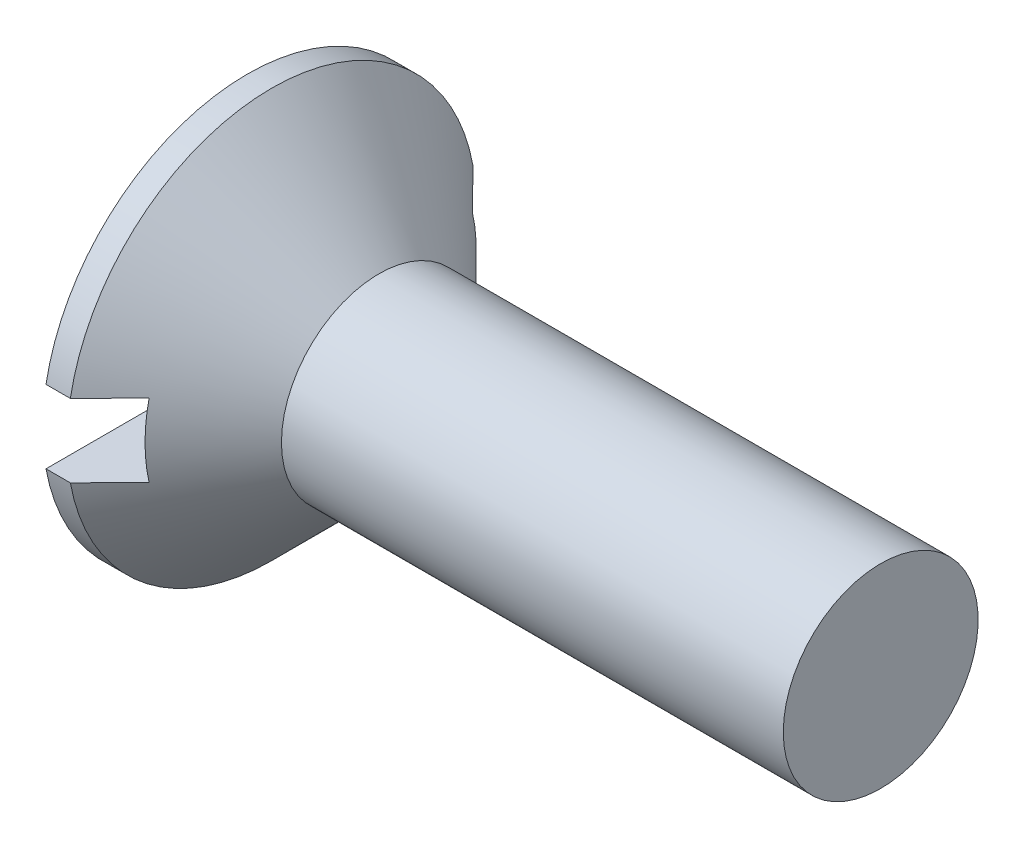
from build123d import *

# Parameters (mm, degrees)
SKETCH2_W  = 8.4
SKETCH2_H  = 1.5
SLOT_DEPTH = 1.3


with BuildPart() as part:
    # BodySke → Base-Revolve (revolve)
    with BuildSketch(Plane.XY, mode=Mode.PRIVATE) as base_revolve_sk:
        Polygon((0, 0), (0, 4.2), (0.5, 4.2), (2.7, 2), (13, 2), (13, 0), align=None)
    revolve(base_revolve_sk.sketch.rotate(Axis((-6.35, 0, 0), (1, 0, 0)), 90), axis=Axis((-6.35, 0, 0), (1, 0, 0)))

    # Sketch2 → Slot (cut)
    with BuildSketch(Plane.ZY):
        Rectangle(SKETCH2_W, SKETCH2_H)
    extrude(amount=-SLOT_DEPTH, mode=Mode.SUBTRACT)


solid = part.part
